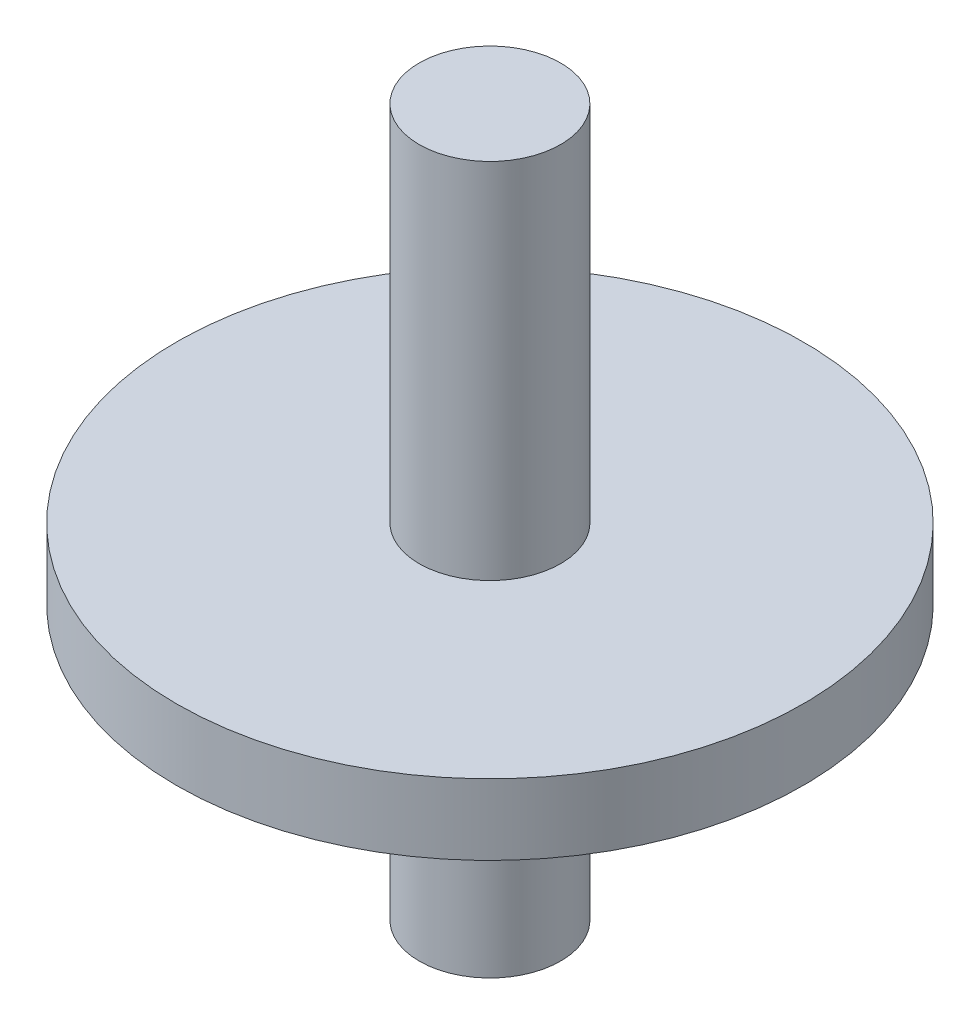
from build123d import *


with BuildPart() as part:
    # Sketch1 → Base-Revolve (revolve)
    with BuildSketch(Plane.XY, mode=Mode.PRIVATE) as base_revolve_sk:
        Polygon((12.7, 0), (12.7, 49.110300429), (56.291523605, 49.110300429), (56.291523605, 61.810300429), (12.7, 61.810300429), (12.7, 127), (0, 127), (0, 0), align=None)
    revolve(base_revolve_sk.sketch.rotate(Axis((0, 92.660944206, 0), (0, -1, 0)), 90), axis=Axis((0, 92.660944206, 0), (0, -1, 0)))


solid = part.part
